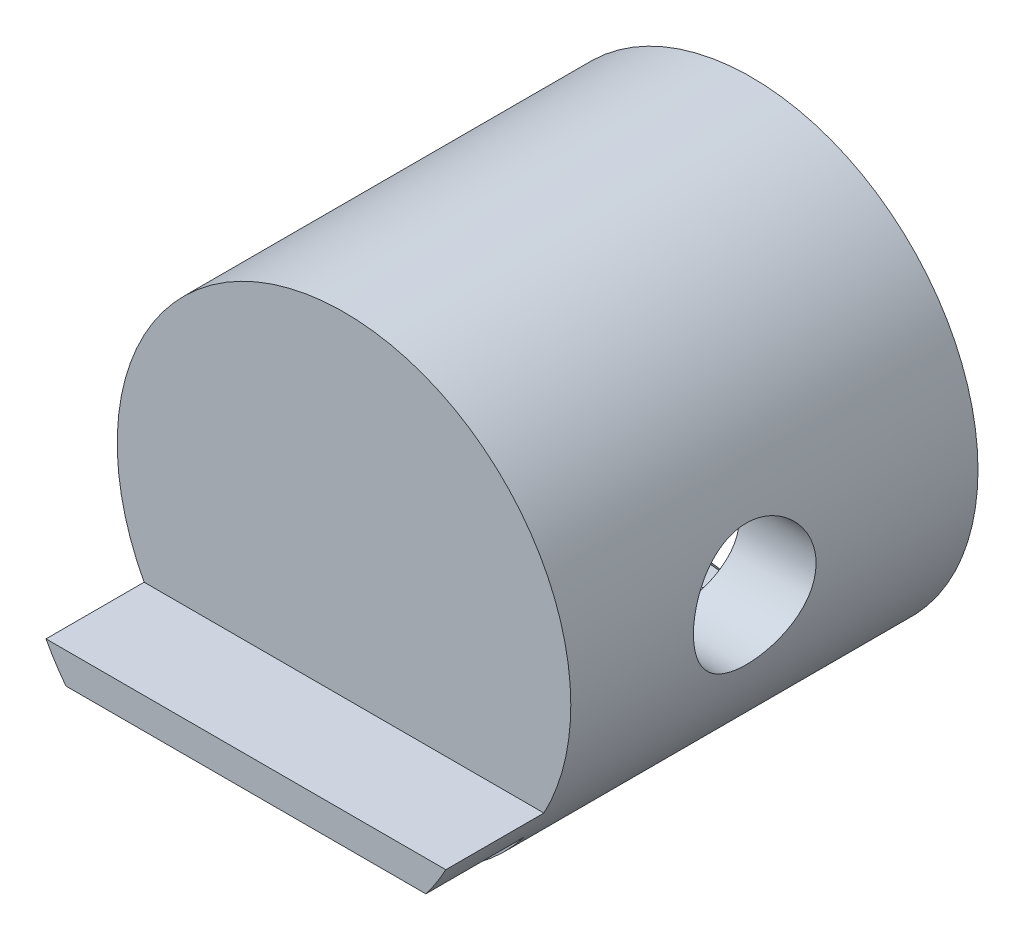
ISO-10303-21;
HEADER;
FILE_DESCRIPTION(('STEP AP214'),'2;1');
FILE_NAME('part.step','',(''),(''),'','','');
FILE_SCHEMA(('AUTOMOTIVE_DESIGN { 1 0 10303 214 1 1 1 1 }'));
ENDSEC;
DATA;
#1=APPLICATION_CONTEXT('core data for automotive mechanical design processes');
#2=APPLICATION_PROTOCOL_DEFINITION('international standard','automotive_design',2000,#1);
#3=PRODUCT_CONTEXT('',#1,'mechanical');
#4=PRODUCT('Part','Part','',(#3));
#5=PRODUCT_RELATED_PRODUCT_CATEGORY('part','',(#4));
#6=PRODUCT_DEFINITION_FORMATION('','',#4);
#7=PRODUCT_DEFINITION_CONTEXT('part definition',#1,'design');
#8=PRODUCT_DEFINITION('design','',#6,#7);
#9=PRODUCT_DEFINITION_SHAPE('','',#8);
#10=(LENGTH_UNIT() NAMED_UNIT(*) SI_UNIT(.MILLI.,.METRE.));
#11=(NAMED_UNIT(*) PLANE_ANGLE_UNIT() SI_UNIT($,.RADIAN.));
#12=(NAMED_UNIT(*) SI_UNIT($,.STERADIAN.) SOLID_ANGLE_UNIT());
#13=UNCERTAINTY_MEASURE_WITH_UNIT(LENGTH_MEASURE(1.E-05),#10,'distance_accuracy_value','');
#14=(GEOMETRIC_REPRESENTATION_CONTEXT(3) GLOBAL_UNCERTAINTY_ASSIGNED_CONTEXT((#13)) GLOBAL_UNIT_ASSIGNED_CONTEXT((#10,
#11,#12)) REPRESENTATION_CONTEXT('',''));
#15=CARTESIAN_POINT('',(0.,0.,0.));
#16=DIRECTION('',(0.,0.,1.));
#17=DIRECTION('',(1.,0.,0.));
#18=AXIS2_PLACEMENT_3D('',#15,#16,#17);
#19=CARTESIAN_POINT('',(0.,0.,26.0095999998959));
#20=DIRECTION('',(0.,0.,-1.));
#21=DIRECTION('',(-1.,0.,0.));
#22=AXIS2_PLACEMENT_3D('',#19,#20,#21);
#23=PLANE('',#22);
#24=CARTESIAN_POINT('',(0.,0.,26.0095999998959));
#25=DIRECTION('',(0.,0.,1.));
#26=DIRECTION('',(0.,1.,0.));
#27=AXIS2_PLACEMENT_3D('',#24,#25,#26);
#28=CIRCLE('',#27,12.1242666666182);
#29=CARTESIAN_POINT('',(0.,-12.1242666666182,26.0095999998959));
#30=VERTEX_POINT('',#29);
#31=CARTESIAN_POINT('',(0.,12.1242666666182,26.0095999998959));
#32=VERTEX_POINT('',#31);
#33=EDGE_CURVE('E242',#30,#32,#28,.F.);
#34=ORIENTED_EDGE('',*,*,#33,.T.);
#35=CARTESIAN_POINT('',(0.,0.,26.0095999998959));
#36=DIRECTION('',(0.,0.,1.));
#37=DIRECTION('',(0.,-1.,0.));
#38=AXIS2_PLACEMENT_3D('',#35,#36,#37);
#39=CIRCLE('',#38,12.1242666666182);
#40=EDGE_CURVE('E237',#32,#30,#39,.F.);
#41=ORIENTED_EDGE('',*,*,#40,.T.);
#42=EDGE_LOOP('',(#34,#41));
#43=FACE_BOUND('',#42,.T.);
#44=ADVANCED_FACE('F15',(#43),#23,.T.);
#45=CARTESIAN_POINT('',(0.,0.,23.909866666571));
#46=DIRECTION('',(0.,0.,-1.));
#47=DIRECTION('',(0.,-1.,0.));
#48=AXIS2_PLACEMENT_3D('',#45,#46,#47);
#49=TOROIDAL_SURFACE('',#48,12.1242666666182,2.09973333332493);
#50=ORIENTED_EDGE('',*,*,#33,.F.);
#51=ORIENTED_EDGE('',*,*,#40,.F.);
#52=EDGE_LOOP('',(#50,#51));
#53=FACE_BOUND('',#52,.T.);
#54=CARTESIAN_POINT('',(0.,0.,23.909866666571));
#55=DIRECTION('',(0.,0.,-1.));
#56=DIRECTION('',(-1.,0.,0.));
#57=AXIS2_PLACEMENT_3D('',#54,#55,#56);
#58=CIRCLE('',#57,14.2239999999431);
#59=CARTESIAN_POINT('',(-14.2239999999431,0.,23.909866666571));
#60=VERTEX_POINT('',#59);
#61=EDGE_CURVE('E246',#60,#60,#58,.T.);
#62=ORIENTED_EDGE('',*,*,#61,.T.);
#63=EDGE_LOOP('',(#62));
#64=FACE_BOUND('',#63,.T.);
#65=ADVANCED_FACE('F238',(#53,#64),#49,.F.);
#66=CARTESIAN_POINT('',(0.,0.,26.2737599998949));
#67=DIRECTION('',(0.,0.,-1.));
#68=DIRECTION('',(-1.,0.,0.));
#69=AXIS2_PLACEMENT_3D('',#66,#67,#68);
#70=CYLINDRICAL_SURFACE('',#69,14.2239999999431);
#71=ORIENTED_EDGE('',*,*,#61,.F.);
#72=EDGE_LOOP('',(#71));
#73=FACE_BOUND('',#72,.T.);
#74=CARTESIAN_POINT('',(0.,0.,22.826133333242));
#75=DIRECTION('',(0.,0.,-1.));
#76=DIRECTION('',(0.,-1.,0.));
#77=AXIS2_PLACEMENT_3D('',#74,#75,#76);
#78=CIRCLE('',#77,14.2239999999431);
#79=CARTESIAN_POINT('',(0.,-14.2239999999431,22.826133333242));
#80=VERTEX_POINT('',#79);
#81=EDGE_CURVE('E249',#80,#80,#78,.T.);
#82=ORIENTED_EDGE('',*,*,#81,.T.);
#83=EDGE_LOOP('',(#82));
#84=FACE_BOUND('',#83,.T.);
#85=ADVANCED_FACE('F261',(#73,#84),#70,.F.);
#86=CARTESIAN_POINT('',(0.,0.,4.67359999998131));
#87=DIRECTION('',(0.,0.,-1.));
#88=DIRECTION('',(0.,-1.,0.));
#89=AXIS2_PLACEMENT_3D('',#86,#87,#88);
#90=TOROIDAL_SURFACE('',#89,11.8956666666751,2.09973333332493);
#91=CARTESIAN_POINT('',(0.,0.,4.67359999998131));
#92=DIRECTION('',(0.,0.,-1.));
#93=DIRECTION('',(-1.,0.,0.));
#94=AXIS2_PLACEMENT_3D('',#91,#92,#93);
#95=CIRCLE('',#94,13.9954);
#96=CARTESIAN_POINT('',(-13.9954,0.,4.67359999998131));
#97=VERTEX_POINT('',#96);
#98=EDGE_CURVE('E253',#97,#97,#95,.T.);
#99=ORIENTED_EDGE('',*,*,#98,.T.);
#100=EDGE_LOOP('',(#99));
#101=FACE_BOUND('',#100,.T.);
#102=CARTESIAN_POINT('',(0.,0.,6.77333333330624));
#103=DIRECTION('',(0.,0.,1.));
#104=DIRECTION('',(0.,-1.,0.));
#105=AXIS2_PLACEMENT_3D('',#102,#103,#104);
#106=CIRCLE('',#105,11.8956666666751);
#107=CARTESIAN_POINT('',(0.,11.8956666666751,6.77333333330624));
#108=VERTEX_POINT('',#107);
#109=CARTESIAN_POINT('',(0.,-11.8956666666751,6.77333333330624));
#110=VERTEX_POINT('',#109);
#111=EDGE_CURVE('E180',#108,#110,#106,.F.);
#112=ORIENTED_EDGE('',*,*,#111,.F.);
#113=CARTESIAN_POINT('',(0.,0.,6.77333333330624));
#114=DIRECTION('',(0.,0.,1.));
#115=DIRECTION('',(0.,1.,0.));
#116=AXIS2_PLACEMENT_3D('',#113,#114,#115);
#117=CIRCLE('',#116,11.8956666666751);
#118=EDGE_CURVE('E168',#110,#108,#117,.F.);
#119=ORIENTED_EDGE('',*,*,#118,.F.);
#120=EDGE_LOOP('',(#112,#119));
#121=FACE_BOUND('',#120,.T.);
#122=ADVANCED_FACE('F204',(#101,#121),#90,.F.);
#123=CARTESIAN_POINT('',(0.,0.,22.826133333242));
#124=DIRECTION('',(0.,0.,-1.));
#125=DIRECTION('',(0.,-1.,0.));
#126=AXIS2_PLACEMENT_3D('',#123,#124,#125);
#127=TOROIDAL_SURFACE('',#126,12.1242666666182,2.09973333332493);
#128=ORIENTED_EDGE('',*,*,#81,.F.);
#129=EDGE_LOOP('',(#128));
#130=FACE_BOUND('',#129,.T.);
#131=CARTESIAN_POINT('',(0.,0.,20.7263999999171));
#132=DIRECTION('',(0.,0.,-1.));
#133=DIRECTION('',(0.,-1.,0.));
#134=AXIS2_PLACEMENT_3D('',#131,#132,#133);
#135=CIRCLE('',#134,12.1242666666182);
#136=CARTESIAN_POINT('',(0.,-12.1242666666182,20.7263999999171));
#137=VERTEX_POINT('',#136);
#138=CARTESIAN_POINT('',(0.,12.1242666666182,20.7263999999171));
#139=VERTEX_POINT('',#138);
#140=EDGE_CURVE('E193',#137,#139,#135,.T.);
#141=ORIENTED_EDGE('',*,*,#140,.T.);
#142=CARTESIAN_POINT('',(0.,0.,20.7263999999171));
#143=DIRECTION('',(0.,0.,-1.));
#144=DIRECTION('',(0.,1.,0.));
#145=AXIS2_PLACEMENT_3D('',#142,#143,#144);
#146=CIRCLE('',#145,12.1242666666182);
#147=EDGE_CURVE('E279',#139,#137,#146,.T.);
#148=ORIENTED_EDGE('',*,*,#147,.T.);
#149=EDGE_LOOP('',(#141,#148));
#150=FACE_BOUND('',#149,.T.);
#151=ADVANCED_FACE('F199',(#130,#150),#127,.F.);
#152=CARTESIAN_POINT('',(0.,0.,7.11199999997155));
#153=DIRECTION('',(0.,0.,-1.));
#154=DIRECTION('',(-1.,0.,0.));
#155=AXIS2_PLACEMENT_3D('',#152,#153,#154);
#156=CYLINDRICAL_SURFACE('',#155,13.9954);
#157=ORIENTED_EDGE('',*,*,#98,.F.);
#158=EDGE_LOOP('',(#157));
#159=FACE_BOUND('',#158,.T.);
#160=CARTESIAN_POINT('',(0.,0.,1.01599999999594));
#161=DIRECTION('',(0.,0.,-1.));
#162=DIRECTION('',(0.,-1.,0.));
#163=AXIS2_PLACEMENT_3D('',#160,#161,#162);
#164=CIRCLE('',#163,13.9954);
#165=CARTESIAN_POINT('',(0.,-13.9954,1.01599999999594));
#166=VERTEX_POINT('',#165);
#167=EDGE_CURVE('E184',#166,#166,#164,.T.);
#168=ORIENTED_EDGE('',*,*,#167,.T.);
#169=EDGE_LOOP('',(#168));
#170=FACE_BOUND('',#169,.T.);
#171=ADVANCED_FACE('F203',(#159,#170),#156,.F.);
#172=CARTESIAN_POINT('',(0.,0.,6.77333333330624));
#173=DIRECTION('',(0.,0.,-1.));
#174=DIRECTION('',(-1.,0.,0.));
#175=AXIS2_PLACEMENT_3D('',#172,#173,#174);
#176=PLANE('',#175);
#177=CARTESIAN_POINT('',(0.,0.,6.77333333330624));
#178=DIRECTION('',(0.,0.,1.));
#179=DIRECTION('',(1.,0.,0.));
#180=AXIS2_PLACEMENT_3D('',#177,#178,#179);
#181=CIRCLE('',#180,10.3505);
#182=CARTESIAN_POINT('',(10.3505,0.,6.77333333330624));
#183=VERTEX_POINT('',#182);
#184=EDGE_CURVE('E192',#183,#183,#181,.T.);
#185=ORIENTED_EDGE('',*,*,#184,.T.);
#186=EDGE_LOOP('',(#185));
#187=FACE_BOUND('',#186,.T.);
#188=ORIENTED_EDGE('',*,*,#118,.T.);
#189=ORIENTED_EDGE('',*,*,#111,.T.);
#190=EDGE_LOOP('',(#188,#189));
#191=FACE_BOUND('',#190,.T.);
#192=ADVANCED_FACE('F142',(#187,#191),#176,.T.);
#193=CARTESIAN_POINT('',(0.,0.,20.7263999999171));
#194=DIRECTION('',(0.,0.,-1.));
#195=DIRECTION('',(-1.,0.,0.));
#196=AXIS2_PLACEMENT_3D('',#193,#194,#195);
#197=PLANE('',#196);
#198=CARTESIAN_POINT('',(0.,0.,20.7263999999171));
#199=DIRECTION('',(0.,0.,1.));
#200=DIRECTION('',(1.,0.,0.));
#201=AXIS2_PLACEMENT_3D('',#198,#199,#200);
#202=CIRCLE('',#201,10.3505);
#203=CARTESIAN_POINT('',(10.3505,0.,20.7263999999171));
#204=VERTEX_POINT('',#203);
#205=EDGE_CURVE('E464',#204,#204,#202,.F.);
#206=ORIENTED_EDGE('',*,*,#205,.T.);
#207=EDGE_LOOP('',(#206));
#208=FACE_BOUND('',#207,.T.);
#209=ORIENTED_EDGE('',*,*,#147,.F.);
#210=ORIENTED_EDGE('',*,*,#140,.F.);
#211=EDGE_LOOP('',(#209,#210));
#212=FACE_BOUND('',#211,.T.);
#213=ADVANCED_FACE('F137',(#208,#212),#197,.F.);
#214=CARTESIAN_POINT('',(0.,0.,0.));
#215=DIRECTION('',(0.,0.,-1.));
#216=DIRECTION('',(-1.,0.,0.));
#217=AXIS2_PLACEMENT_3D('',#214,#215,#216);
#218=CONICAL_SURFACE('',#217,15.0113999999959,0.785398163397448);
#219=ORIENTED_EDGE('',*,*,#167,.F.);
#220=EDGE_LOOP('',(#219));
#221=FACE_BOUND('',#220,.T.);
#222=CARTESIAN_POINT('',(0.,0.,0.));
#223=DIRECTION('',(0.,0.,-1.));
#224=DIRECTION('',(-1.,0.,0.));
#225=AXIS2_PLACEMENT_3D('',#222,#223,#224);
#226=CIRCLE('',#225,15.0113999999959);
#227=CARTESIAN_POINT('',(-15.0113999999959,0.,0.));
#228=VERTEX_POINT('',#227);
#229=EDGE_CURVE('E456',#228,#228,#226,.T.);
#230=ORIENTED_EDGE('',*,*,#229,.T.);
#231=EDGE_LOOP('',(#230));
#232=FACE_BOUND('',#231,.T.);
#233=ADVANCED_FACE('F132',(#221,#232),#218,.F.);
#234=CARTESIAN_POINT('',(0.,0.,0.));
#235=DIRECTION('',(0.,0.,1.));
#236=DIRECTION('',(1.,0.,0.));
#237=AXIS2_PLACEMENT_3D('',#234,#235,#236);
#238=CYLINDRICAL_SURFACE('',#237,10.3505);
#239=CARTESIAN_POINT('',(9.4451966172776,4.2333333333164,15.4093333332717));
#240=CARTESIAN_POINT('',(9.44519295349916,4.23333680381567,15.5226751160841));
#241=CARTESIAN_POINT('',(9.44724114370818,4.2287793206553,15.635982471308));
#242=CARTESIAN_POINT('',(9.45535377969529,4.21061083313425,15.8617558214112));
#243=CARTESIAN_POINT('',(9.46141883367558,4.19699845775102,15.9742216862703));
#244=CARTESIAN_POINT('',(9.47736950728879,4.16085396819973,16.1974960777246));
#245=CARTESIAN_POINT('',(9.48725716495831,4.13831709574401,16.3083036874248));
#246=CARTESIAN_POINT('',(9.51052004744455,4.08456937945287,16.5274357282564));
#247=CARTESIAN_POINT('',(9.52389665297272,4.05335510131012,16.6357591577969));
#248=CARTESIAN_POINT('',(9.56854291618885,3.94737428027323,16.9551126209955));
#249=CARTESIAN_POINT('',(9.60440467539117,3.86010877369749,17.1615035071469));
#250=CARTESIAN_POINT('',(9.68426812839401,3.65510928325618,17.5566428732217));
#251=CARTESIAN_POINT('',(9.72827127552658,3.53736985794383,17.7453881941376));
#252=CARTESIAN_POINT('',(9.82238757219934,3.26727528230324,18.1112732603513));
#253=CARTESIAN_POINT('',(9.8727024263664,3.11339295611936,18.2872340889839));
#254=CARTESIAN_POINT('',(9.97213700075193,2.77844453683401,18.6117858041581));
#255=CARTESIAN_POINT('',(10.0212562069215,2.59736698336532,18.760365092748));
#256=CARTESIAN_POINT('',(10.0912129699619,2.30455545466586,18.962507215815));
#257=CARTESIAN_POINT('',(10.1143380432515,2.20109388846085,19.0275193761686));
#258=CARTESIAN_POINT('',(10.1582561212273,1.98857517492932,19.1485325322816));
#259=CARTESIAN_POINT('',(10.1790500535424,1.87952027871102,19.2045371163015));
#260=CARTESIAN_POINT('',(10.217692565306,1.65662049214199,19.306993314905));
#261=CARTESIAN_POINT('',(10.2355435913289,1.54277968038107,19.3534528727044));
#262=CARTESIAN_POINT('',(10.2677931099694,1.31109226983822,19.4364031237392));
#263=CARTESIAN_POINT('',(10.2821924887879,1.19324670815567,19.4728963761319));
#264=CARTESIAN_POINT('',(10.3128379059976,0.89939141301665,19.5499471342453));
#265=CARTESIAN_POINT('',(10.3268840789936,0.721572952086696,19.5846459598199));
#266=CARTESIAN_POINT('',(10.3457123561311,0.362473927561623,19.6310015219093));
#267=CARTESIAN_POINT('',(10.3504957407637,0.181193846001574,19.6426614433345));
#268=CARTESIAN_POINT('',(10.3505026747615,-0.113788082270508,19.6426699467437));
#269=CARTESIAN_POINT('',(10.3486205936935,-0.227542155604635,19.6380769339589));
#270=CARTESIAN_POINT('',(10.3411497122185,-0.454224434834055,19.6197626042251));
#271=CARTESIAN_POINT('',(10.3355602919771,-0.567152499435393,19.6060397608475));
#272=CARTESIAN_POINT('',(10.3208150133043,-0.791361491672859,19.5695931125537));
#273=CARTESIAN_POINT('',(10.3116575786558,-0.902641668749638,19.5468653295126));
#274=CARTESIAN_POINT('',(10.2900235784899,-1.12273101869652,19.4926473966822));
#275=CARTESIAN_POINT('',(10.2775457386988,-1.23153922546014,19.4611538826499));
#276=CARTESIAN_POINT('',(10.2356696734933,-1.5524766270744,19.354149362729));
#277=CARTESIAN_POINT('',(10.2017703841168,-1.75995470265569,19.2659763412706));
#278=CARTESIAN_POINT('',(10.1252830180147,-2.15697024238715,19.0588307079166));
#279=CARTESIAN_POINT('',(10.082693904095,-2.34650556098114,18.9398544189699));
#280=CARTESIAN_POINT('',(9.9908074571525,-2.71175596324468,18.6684022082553));
#281=CARTESIAN_POINT('',(9.94129663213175,-2.88648790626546,18.514676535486));
#282=CARTESIAN_POINT('',(9.84206376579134,-3.20859638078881,18.1805871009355));
#283=CARTESIAN_POINT('',(9.79234162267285,-3.35595770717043,18.0002086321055));
#284=CARTESIAN_POINT('',(9.72046643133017,-3.55679347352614,17.7082930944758));
#285=CARTESIAN_POINT('',(9.69645024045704,-3.6215838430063,17.6048252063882));
#286=CARTESIAN_POINT('',(9.65055844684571,-3.74215541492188,17.3923326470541));
#287=CARTESIAN_POINT('',(9.62868199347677,-3.79794020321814,17.2833102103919));
#288=CARTESIAN_POINT('',(9.58780919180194,-3.89997298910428,17.0604914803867));
#289=CARTESIAN_POINT('',(9.56881022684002,-3.94622966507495,16.9466996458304));
#290=CARTESIAN_POINT('',(9.53433895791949,-4.02879962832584,16.715090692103));
#291=CARTESIAN_POINT('',(9.51886569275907,-4.06511562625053,16.5972746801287));
#292=CARTESIAN_POINT('',(9.48594347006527,-4.14152157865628,16.3043349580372));
#293=CARTESIAN_POINT('',(9.47077176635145,-4.17587604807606,16.1274154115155));
#294=CARTESIAN_POINT('',(9.45040223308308,-4.22177692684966,15.7700788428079));
#295=CARTESIAN_POINT('',(9.44520244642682,-4.23332781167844,15.5896625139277));
#296=CARTESIAN_POINT('',(9.44519295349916,-4.23333680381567,15.2959915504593));
#297=CARTESIAN_POINT('',(9.44724114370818,-4.2287793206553,15.1826841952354));
#298=CARTESIAN_POINT('',(9.45535377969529,-4.21061083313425,14.9569108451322));
#299=CARTESIAN_POINT('',(9.46141883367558,-4.19699845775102,14.8444449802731));
#300=CARTESIAN_POINT('',(9.47736950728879,-4.16085396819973,14.6211705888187));
#301=CARTESIAN_POINT('',(9.48725716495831,-4.13831709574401,14.5103629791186));
#302=CARTESIAN_POINT('',(9.51052004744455,-4.08456937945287,14.291230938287));
#303=CARTESIAN_POINT('',(9.52389665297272,-4.05335510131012,14.1829075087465));
#304=CARTESIAN_POINT('',(9.56854291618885,-3.94737428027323,13.8635540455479));
#305=CARTESIAN_POINT('',(9.60440467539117,-3.86010877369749,13.6571631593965));
#306=CARTESIAN_POINT('',(9.68426812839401,-3.65510928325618,13.2620237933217));
#307=CARTESIAN_POINT('',(9.72827127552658,-3.53736985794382,13.0732784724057));
#308=CARTESIAN_POINT('',(9.82238757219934,-3.26727528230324,12.7073934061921));
#309=CARTESIAN_POINT('',(9.8727024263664,-3.11339295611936,12.5314325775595));
#310=CARTESIAN_POINT('',(9.97213700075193,-2.77844453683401,12.2068808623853));
#311=CARTESIAN_POINT('',(10.0212562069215,-2.59736698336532,12.0583015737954));
#312=CARTESIAN_POINT('',(10.0912129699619,-2.30455545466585,11.8561594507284));
#313=CARTESIAN_POINT('',(10.1143380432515,-2.20109388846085,11.7911472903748));
#314=CARTESIAN_POINT('',(10.1582561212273,-1.98857517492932,11.6701341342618));
#315=CARTESIAN_POINT('',(10.1790500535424,-1.87952027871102,11.6141295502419));
#316=CARTESIAN_POINT('',(10.217692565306,-1.65662049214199,11.5116733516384));
#317=CARTESIAN_POINT('',(10.2355435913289,-1.54277968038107,11.465213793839));
#318=CARTESIAN_POINT('',(10.2677931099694,-1.31109226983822,11.3822635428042));
#319=CARTESIAN_POINT('',(10.2821924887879,-1.19324670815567,11.3457702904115));
#320=CARTESIAN_POINT('',(10.3128379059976,-0.899391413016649,11.2687195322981));
#321=CARTESIAN_POINT('',(10.3268840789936,-0.721572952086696,11.2340207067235));
#322=CARTESIAN_POINT('',(10.3457123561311,-0.362473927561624,11.1876651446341));
#323=CARTESIAN_POINT('',(10.3504957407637,-0.181193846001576,11.1760052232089));
#324=CARTESIAN_POINT('',(10.3505026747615,0.113788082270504,11.1759967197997));
#325=CARTESIAN_POINT('',(10.3486205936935,0.227542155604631,11.1805897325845));
#326=CARTESIAN_POINT('',(10.3411497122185,0.454224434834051,11.1989040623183));
#327=CARTESIAN_POINT('',(10.3355602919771,0.567152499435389,11.2126269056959));
#328=CARTESIAN_POINT('',(10.3208150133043,0.791361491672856,11.2490735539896));
#329=CARTESIAN_POINT('',(10.3116575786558,0.902641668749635,11.2718013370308));
#330=CARTESIAN_POINT('',(10.2900235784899,1.12273101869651,11.3260192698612));
#331=CARTESIAN_POINT('',(10.2775457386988,1.23153922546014,11.3575127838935));
#332=CARTESIAN_POINT('',(10.2356696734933,1.55247662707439,11.4645173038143));
#333=CARTESIAN_POINT('',(10.2017703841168,1.75995470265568,11.5526903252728));
#334=CARTESIAN_POINT('',(10.1252830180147,2.15697024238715,11.7598359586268));
#335=CARTESIAN_POINT('',(10.082693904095,2.34650556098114,11.8788122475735));
#336=CARTESIAN_POINT('',(9.9908074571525,2.71175596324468,12.1502644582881));
#337=CARTESIAN_POINT('',(9.94129663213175,2.88648790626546,12.3039901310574));
#338=CARTESIAN_POINT('',(9.84206376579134,3.2085963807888,12.6380795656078));
#339=CARTESIAN_POINT('',(9.79234162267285,3.35595770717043,12.8184580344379));
#340=CARTESIAN_POINT('',(9.72046643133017,3.55679347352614,13.1103735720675));
#341=CARTESIAN_POINT('',(9.69645024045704,3.6215838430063,13.2138414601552));
#342=CARTESIAN_POINT('',(9.65055844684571,3.74215541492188,13.4263340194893));
#343=CARTESIAN_POINT('',(9.62868199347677,3.79794020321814,13.5353564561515));
#344=CARTESIAN_POINT('',(9.58780919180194,3.89997298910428,13.7581751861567));
#345=CARTESIAN_POINT('',(9.56881022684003,3.94622966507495,13.871967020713));
#346=CARTESIAN_POINT('',(9.5343389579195,4.02879962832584,14.1035759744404));
#347=CARTESIAN_POINT('',(9.51886569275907,4.06511562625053,14.2213919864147));
#348=CARTESIAN_POINT('',(9.48594347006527,4.14152157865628,14.5143317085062));
#349=CARTESIAN_POINT('',(9.47077176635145,4.17587604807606,14.6912512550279));
#350=CARTESIAN_POINT('',(9.45040223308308,4.22177692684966,15.0485878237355));
#351=CARTESIAN_POINT('',(9.44520244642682,4.23332781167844,15.2290041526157));
#352=CARTESIAN_POINT('',(9.4451966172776,4.2333333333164,15.4093333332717));
#353=B_SPLINE_CURVE_WITH_KNOTS('',3,(#239,#240,#241,#242,#243,#244,#245,#246,#247,#248,#249,
#250,#251,#252,#253,#254,#255,#256,#257,#258,#259,#260,#261,#262,#263,#264,#265,#266,#267,#268,
#269,#270,#271,#272,#273,#274,#275,#276,#277,#278,#279,#280,#281,#282,#283,#284,#285,#286,#287,
#288,#289,#290,#291,#292,#293,#294,#295,#296,#297,#298,#299,#300,#301,#302,#303,#304,#305,#306,
#307,#308,#309,#310,#311,#312,#313,#314,#315,#316,#317,#318,#319,#320,#321,#322,#323,#324,#325,
#326,#327,#328,#329,#330,#331,#332,#333,#334,#335,#336,#337,#338,#339,#340,#341,#342,#343,#344,
#345,#346,#347,#348,#349,#350,#351,#352),.UNSPECIFIED.,.T.,.F.,(4,2,2,2,2,2,2,2,2,2,2,2,2,2,2,2,
2,2,2,2,2,2,2,2,2,2,2,2,2,2,2,2,2,2,2,2,2,2,2,2,2,2,2,2,2,2,2,2,2,2,2,2,2,2,2,2,4),(0.,
0.339855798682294,0.67976306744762,1.01985180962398,1.36007534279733,2.03757886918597,
2.71520345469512,3.42945860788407,4.1440156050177,4.5167025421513,4.88924064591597,
5.26146746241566,5.63359860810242,6.17698905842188,6.72030438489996,7.06150145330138,
7.4027555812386,7.74416063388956,8.08569689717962,8.76625335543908,9.44689109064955,
10.1576575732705,10.8688177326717,11.2416852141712,11.6144038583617,11.9867815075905,
12.3590575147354,12.8998814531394,13.4405992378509,13.7804550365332,14.1203623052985,
14.4604510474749,14.8006745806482,15.4781781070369,16.155802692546,16.870057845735,
17.5846148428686,17.9573017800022,18.3298398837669,18.7020667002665,19.0741978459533,
19.6175882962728,20.1609036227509,20.5021006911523,20.8433548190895,21.1847598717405,
21.5262961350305,22.20685259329,22.8874903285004,23.5982568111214,24.3094169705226,
24.6822844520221,25.0550030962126,25.4273807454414,25.7996567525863,26.3404806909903,
26.8811984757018),.UNSPECIFIED.);
#354=CARTESIAN_POINT('',(9.4451966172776,4.2333333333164,15.4093333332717));
#355=VERTEX_POINT('',#354);
#356=EDGE_CURVE('E123',#355,#355,#353,.T.);
#357=ORIENTED_EDGE('',*,*,#356,.T.);
#358=EDGE_LOOP('',(#357));
#359=FACE_BOUND('',#358,.T.);
#360=ORIENTED_EDGE('',*,*,#205,.F.);
#361=EDGE_LOOP('',(#360));
#362=FACE_BOUND('',#361,.T.);
#363=CARTESIAN_POINT('',(-10.3505,0.,11.1759999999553));
#364=CARTESIAN_POINT('',(-10.3505026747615,-0.113788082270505,11.1759967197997));
#365=CARTESIAN_POINT('',(-10.3486205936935,-0.227542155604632,11.1805897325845));
#366=CARTESIAN_POINT('',(-10.3411497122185,-0.454224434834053,11.1989040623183));
#367=CARTESIAN_POINT('',(-10.3355602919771,-0.567152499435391,11.2126269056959));
#368=CARTESIAN_POINT('',(-10.3208150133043,-0.791361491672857,11.2490735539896));
#369=CARTESIAN_POINT('',(-10.3116575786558,-0.902641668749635,11.2718013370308));
#370=CARTESIAN_POINT('',(-10.2900235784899,-1.12273101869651,11.3260192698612));
#371=CARTESIAN_POINT('',(-10.2775457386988,-1.23153922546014,11.3575127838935));
#372=CARTESIAN_POINT('',(-10.2356696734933,-1.55247662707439,11.4645173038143));
#373=CARTESIAN_POINT('',(-10.2017703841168,-1.75995470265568,11.5526903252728));
#374=CARTESIAN_POINT('',(-10.1252830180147,-2.15697024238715,11.7598359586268));
#375=CARTESIAN_POINT('',(-10.082693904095,-2.34650556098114,11.8788122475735));
#376=CARTESIAN_POINT('',(-9.9908074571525,-2.71175596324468,12.1502644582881));
#377=CARTESIAN_POINT('',(-9.94129663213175,-2.88648790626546,12.3039901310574));
#378=CARTESIAN_POINT('',(-9.84206376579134,-3.2085963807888,12.6380795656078));
#379=CARTESIAN_POINT('',(-9.79234162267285,-3.35595770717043,12.8184580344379));
#380=CARTESIAN_POINT('',(-9.72046643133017,-3.55679347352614,13.1103735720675));
#381=CARTESIAN_POINT('',(-9.69645024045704,-3.6215838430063,13.2138414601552));
#382=CARTESIAN_POINT('',(-9.65055844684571,-3.74215541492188,13.4263340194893));
#383=CARTESIAN_POINT('',(-9.62868199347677,-3.79794020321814,13.5353564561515));
#384=CARTESIAN_POINT('',(-9.58780919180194,-3.89997298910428,13.7581751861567));
#385=CARTESIAN_POINT('',(-9.56881022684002,-3.94622966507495,13.871967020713));
#386=CARTESIAN_POINT('',(-9.5343389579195,-4.02879962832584,14.1035759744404));
#387=CARTESIAN_POINT('',(-9.51886569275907,-4.06511562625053,14.2213919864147));
#388=CARTESIAN_POINT('',(-9.48594347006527,-4.14152157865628,14.5143317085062));
#389=CARTESIAN_POINT('',(-9.47077176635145,-4.17587604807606,14.6912512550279));
#390=CARTESIAN_POINT('',(-9.45040223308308,-4.22177692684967,15.0485878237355));
#391=CARTESIAN_POINT('',(-9.44520244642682,-4.23332781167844,15.2290041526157));
#392=CARTESIAN_POINT('',(-9.44519295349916,-4.23333680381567,15.5226751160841));
#393=CARTESIAN_POINT('',(-9.44724114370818,-4.2287793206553,15.635982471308));
#394=CARTESIAN_POINT('',(-9.45535377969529,-4.21061083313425,15.8617558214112));
#395=CARTESIAN_POINT('',(-9.46141883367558,-4.19699845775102,15.9742216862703));
#396=CARTESIAN_POINT('',(-9.47736950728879,-4.16085396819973,16.1974960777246));
#397=CARTESIAN_POINT('',(-9.48725716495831,-4.13831709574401,16.3083036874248));
#398=CARTESIAN_POINT('',(-9.51052004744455,-4.08456937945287,16.5274357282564));
#399=CARTESIAN_POINT('',(-9.52389665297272,-4.05335510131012,16.6357591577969));
#400=CARTESIAN_POINT('',(-9.56854291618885,-3.94737428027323,16.9551126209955));
#401=CARTESIAN_POINT('',(-9.60440467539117,-3.86010877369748,17.1615035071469));
#402=CARTESIAN_POINT('',(-9.68426812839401,-3.65510928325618,17.5566428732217));
#403=CARTESIAN_POINT('',(-9.72827127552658,-3.53736985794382,17.7453881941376));
#404=CARTESIAN_POINT('',(-9.82238757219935,-3.26727528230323,18.1112732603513));
#405=CARTESIAN_POINT('',(-9.87270242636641,-3.11339295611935,18.2872340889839));
#406=CARTESIAN_POINT('',(-9.97213700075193,-2.778444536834,18.6117858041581));
#407=CARTESIAN_POINT('',(-10.0212562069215,-2.59736698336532,18.760365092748));
#408=CARTESIAN_POINT('',(-10.0912129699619,-2.30455545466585,18.962507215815));
#409=CARTESIAN_POINT('',(-10.1143380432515,-2.20109388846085,19.0275193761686));
#410=CARTESIAN_POINT('',(-10.1582561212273,-1.98857517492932,19.1485325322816));
#411=CARTESIAN_POINT('',(-10.1790500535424,-1.87952027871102,19.2045371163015));
#412=CARTESIAN_POINT('',(-10.217692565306,-1.65662049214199,19.306993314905));
#413=CARTESIAN_POINT('',(-10.2355435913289,-1.54277968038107,19.3534528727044));
#414=CARTESIAN_POINT('',(-10.2677931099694,-1.31109226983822,19.4364031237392));
#415=CARTESIAN_POINT('',(-10.2821924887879,-1.19324670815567,19.4728963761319));
#416=CARTESIAN_POINT('',(-10.3128379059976,-0.899391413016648,19.5499471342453));
#417=CARTESIAN_POINT('',(-10.3268840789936,-0.721572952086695,19.5846459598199));
#418=CARTESIAN_POINT('',(-10.3457123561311,-0.362473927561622,19.6310015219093));
#419=CARTESIAN_POINT('',(-10.3504957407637,-0.181193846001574,19.6426614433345));
#420=CARTESIAN_POINT('',(-10.3505026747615,0.113788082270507,19.6426699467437));
#421=CARTESIAN_POINT('',(-10.3486205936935,0.227542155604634,19.6380769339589));
#422=CARTESIAN_POINT('',(-10.3411497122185,0.454224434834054,19.6197626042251));
#423=CARTESIAN_POINT('',(-10.3355602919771,0.567152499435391,19.6060397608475));
#424=CARTESIAN_POINT('',(-10.3208150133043,0.791361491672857,19.5695931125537));
#425=CARTESIAN_POINT('',(-10.3116575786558,0.902641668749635,19.5468653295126));
#426=CARTESIAN_POINT('',(-10.2900235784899,1.12273101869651,19.4926473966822));
#427=CARTESIAN_POINT('',(-10.2775457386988,1.23153922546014,19.4611538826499));
#428=CARTESIAN_POINT('',(-10.2356696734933,1.55247662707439,19.354149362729));
#429=CARTESIAN_POINT('',(-10.2017703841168,1.75995470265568,19.2659763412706));
#430=CARTESIAN_POINT('',(-10.1252830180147,2.15697024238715,19.0588307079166));
#431=CARTESIAN_POINT('',(-10.082693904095,2.34650556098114,18.9398544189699));
#432=CARTESIAN_POINT('',(-9.9908074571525,2.71175596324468,18.6684022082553));
#433=CARTESIAN_POINT('',(-9.94129663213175,2.88648790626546,18.514676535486));
#434=CARTESIAN_POINT('',(-9.84206376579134,3.2085963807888,18.1805871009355));
#435=CARTESIAN_POINT('',(-9.79234162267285,3.35595770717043,18.0002086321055));
#436=CARTESIAN_POINT('',(-9.72046643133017,3.55679347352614,17.7082930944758));
#437=CARTESIAN_POINT('',(-9.69645024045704,3.6215838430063,17.6048252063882));
#438=CARTESIAN_POINT('',(-9.65055844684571,3.74215541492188,17.3923326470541));
#439=CARTESIAN_POINT('',(-9.62868199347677,3.79794020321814,17.2833102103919));
#440=CARTESIAN_POINT('',(-9.58780919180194,3.89997298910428,17.0604914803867));
#441=CARTESIAN_POINT('',(-9.56881022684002,3.94622966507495,16.9466996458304));
#442=CARTESIAN_POINT('',(-9.53433895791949,4.02879962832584,16.715090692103));
#443=CARTESIAN_POINT('',(-9.51886569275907,4.06511562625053,16.5972746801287));
#444=CARTESIAN_POINT('',(-9.48594347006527,4.14152157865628,16.3043349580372));
#445=CARTESIAN_POINT('',(-9.47077176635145,4.17587604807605,16.1274154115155));
#446=CARTESIAN_POINT('',(-9.45040223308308,4.22177692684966,15.7700788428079));
#447=CARTESIAN_POINT('',(-9.44520244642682,4.23332781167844,15.5896625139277));
#448=CARTESIAN_POINT('',(-9.44519295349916,4.23333680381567,15.2959915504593));
#449=CARTESIAN_POINT('',(-9.44724114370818,4.2287793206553,15.1826841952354));
#450=CARTESIAN_POINT('',(-9.45535377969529,4.21061083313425,14.9569108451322));
#451=CARTESIAN_POINT('',(-9.46141883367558,4.19699845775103,14.8444449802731));
#452=CARTESIAN_POINT('',(-9.47736950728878,4.16085396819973,14.6211705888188));
#453=CARTESIAN_POINT('',(-9.48725716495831,4.13831709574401,14.5103629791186));
#454=CARTESIAN_POINT('',(-9.51052004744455,4.08456937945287,14.291230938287));
#455=CARTESIAN_POINT('',(-9.52389665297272,4.05335510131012,14.1829075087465));
#456=CARTESIAN_POINT('',(-9.56854291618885,3.94737428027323,13.8635540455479));
#457=CARTESIAN_POINT('',(-9.60440467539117,3.86010877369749,13.6571631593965));
#458=CARTESIAN_POINT('',(-9.68426812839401,3.65510928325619,13.2620237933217));
#459=CARTESIAN_POINT('',(-9.72827127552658,3.53736985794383,13.0732784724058));
#460=CARTESIAN_POINT('',(-9.82238757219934,3.26727528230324,12.7073934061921));
#461=CARTESIAN_POINT('',(-9.8727024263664,3.11339295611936,12.5314325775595));
#462=CARTESIAN_POINT('',(-9.97213700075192,2.77844453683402,12.2068808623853));
#463=CARTESIAN_POINT('',(-10.0212562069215,2.59736698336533,12.0583015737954));
#464=CARTESIAN_POINT('',(-10.0912129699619,2.30455545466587,11.8561594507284));
#465=CARTESIAN_POINT('',(-10.1143380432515,2.20109388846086,11.7911472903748));
#466=CARTESIAN_POINT('',(-10.1582561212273,1.98857517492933,11.6701341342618));
#467=CARTESIAN_POINT('',(-10.1790500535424,1.87952027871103,11.6141295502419));
#468=CARTESIAN_POINT('',(-10.217692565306,1.65662049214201,11.5116733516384));
#469=CARTESIAN_POINT('',(-10.2355435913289,1.54277968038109,11.465213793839));
#470=CARTESIAN_POINT('',(-10.2677931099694,1.31109226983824,11.3822635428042));
#471=CARTESIAN_POINT('',(-10.2821924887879,1.19324670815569,11.3457702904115));
#472=CARTESIAN_POINT('',(-10.3128379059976,0.899391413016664,11.2687195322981));
#473=CARTESIAN_POINT('',(-10.3268840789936,0.721572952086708,11.2340207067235));
#474=CARTESIAN_POINT('',(-10.3457123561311,0.36247392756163,11.1876651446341));
#475=CARTESIAN_POINT('',(-10.3504957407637,0.181193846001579,11.1760052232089));
#476=CARTESIAN_POINT('',(-10.3505,0.,11.1759999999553));
#477=B_SPLINE_CURVE_WITH_KNOTS('',3,(#363,#364,#365,#366,#367,#368,#369,#370,#371,#372,#373,
#374,#375,#376,#377,#378,#379,#380,#381,#382,#383,#384,#385,#386,#387,#388,#389,#390,#391,#392,
#393,#394,#395,#396,#397,#398,#399,#400,#401,#402,#403,#404,#405,#406,#407,#408,#409,#410,#411,
#412,#413,#414,#415,#416,#417,#418,#419,#420,#421,#422,#423,#424,#425,#426,#427,#428,#429,#430,
#431,#432,#433,#434,#435,#436,#437,#438,#439,#440,#441,#442,#443,#444,#445,#446,#447,#448,#449,
#450,#451,#452,#453,#454,#455,#456,#457,#458,#459,#460,#461,#462,#463,#464,#465,#466,#467,#468,
#469,#470,#471,#472,#473,#474,#475,#476),.UNSPECIFIED.,.T.,.F.,(4,2,2,2,2,2,2,2,2,2,2,2,2,2,2,2,
2,2,2,2,2,2,2,2,2,2,2,2,2,2,2,2,2,2,2,2,2,2,2,2,2,2,2,2,2,2,2,2,2,2,2,2,2,2,2,2,4),(0.,
0.341197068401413,0.682451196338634,1.0238562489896,1.36539251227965,2.04594897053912,
2.72658670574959,3.43735318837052,4.14851334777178,4.52138082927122,4.89409947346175,
5.26647712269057,5.63875312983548,6.17957706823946,6.72029485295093,7.06015065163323,
7.40005792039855,7.74014666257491,8.08037019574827,8.75787372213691,9.43549830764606,
10.149753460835,10.8643104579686,11.2369973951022,11.6095354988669,11.9817623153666,
12.3538934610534,12.8972839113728,13.4405992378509,13.7817963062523,14.1230504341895,
14.4644554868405,14.8059917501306,15.48654820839,16.1671859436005,16.8779524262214,
17.5891125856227,17.9619800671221,18.3346987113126,18.7070763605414,19.0793523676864,
19.6201763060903,20.1608940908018,20.5007498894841,20.8406571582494,21.1807459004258,
21.5209694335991,22.1984729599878,22.8760975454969,23.5903526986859,24.3049096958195,
24.6775966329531,25.0501347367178,25.4223615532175,25.7944926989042,26.3378831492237,
26.8811984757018),.UNSPECIFIED.);
#478=CARTESIAN_POINT('',(-10.3505,0.,11.1759999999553));
#479=VERTEX_POINT('',#478);
#480=EDGE_CURVE('E116',#479,#479,#477,.T.);
#481=ORIENTED_EDGE('',*,*,#480,.T.);
#482=EDGE_LOOP('',(#481));
#483=FACE_BOUND('',#482,.T.);
#484=ORIENTED_EDGE('',*,*,#184,.F.);
#485=EDGE_LOOP('',(#484));
#486=FACE_BOUND('',#485,.T.);
#487=ADVANCED_FACE('F127',(#359,#362,#483,#486),#238,.F.);
#488=CARTESIAN_POINT('',(0.,0.,0.));
#489=DIRECTION('',(0.,0.,1.));
#490=DIRECTION('',(1.,0.,0.));
#491=AXIS2_PLACEMENT_3D('',#488,#489,#490);
#492=PLANE('',#491);
#493=ORIENTED_EDGE('',*,*,#229,.F.);
#494=EDGE_LOOP('',(#493));
#495=FACE_BOUND('',#494,.T.);
#496=CARTESIAN_POINT('',(0.,0.,0.));
#497=DIRECTION('',(0.,0.,1.));
#498=DIRECTION('',(1.,0.,0.));
#499=AXIS2_PLACEMENT_3D('',#496,#497,#498);
#500=CIRCLE('',#499,15.65402);
#501=CARTESIAN_POINT('',(15.65402,0.,0.));
#502=VERTEX_POINT('',#501);
#503=EDGE_CURVE('E97',#502,#502,#500,.T.);
#504=ORIENTED_EDGE('',*,*,#503,.F.);
#505=EDGE_LOOP('',(#504));
#506=FACE_BOUND('',#505,.T.);
#507=ADVANCED_FACE('F131',(#495,#506),#492,.F.);
#508=CARTESIAN_POINT('',(-18.784824,0.,15.4093333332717));
#509=DIRECTION('',(1.,0.,0.));
#510=DIRECTION('',(0.,0.,-1.));
#511=AXIS2_PLACEMENT_3D('',#508,#509,#510);
#512=CYLINDRICAL_SURFACE('',#511,4.2333333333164);
#513=CARTESIAN_POINT('',(15.65402,0.,11.1759999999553));
#514=CARTESIAN_POINT('',(15.6540136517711,-0.233150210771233,11.1760100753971));
#515=CARTESIAN_POINT('',(15.6487574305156,-0.466430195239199,11.1953338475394));
#516=CARTESIAN_POINT('',(15.6282878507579,-0.926339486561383,11.2720073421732));
#517=CARTESIAN_POINT('',(15.613065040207,-1.15296226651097,11.3293931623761));
#518=CARTESIAN_POINT('',(15.5743441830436,-1.59273885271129,11.4801805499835));
#519=CARTESIAN_POINT('',(15.5508584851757,-1.80591220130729,11.5735283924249));
#520=CARTESIAN_POINT('',(15.4980916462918,-2.21354850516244,11.7934015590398));
#521=CARTESIAN_POINT('',(15.4688107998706,-2.40801241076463,11.9199251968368));
#522=CARTESIAN_POINT('',(15.4068313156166,-2.7773622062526,12.2057332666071));
#523=CARTESIAN_POINT('',(15.3740730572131,-2.95174149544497,12.3656594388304));
#524=CARTESIAN_POINT('',(15.3092030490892,-3.27159652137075,12.7124054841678));
#525=CARTESIAN_POINT('',(15.2770915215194,-3.4170624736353,12.8992344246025));
#526=CARTESIAN_POINT('',(15.2165324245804,-3.67746181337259,13.2985894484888));
#527=CARTESIAN_POINT('',(15.1881618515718,-3.79179372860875,13.5115200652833));
#528=CARTESIAN_POINT('',(15.1392225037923,-3.98272404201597,13.9543390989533));
#529=CARTESIAN_POINT('',(15.1186445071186,-4.05936707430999,14.1842070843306));
#530=CARTESIAN_POINT('',(15.0926254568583,-4.15482366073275,14.5808982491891));
#531=CARTESIAN_POINT('',(15.0844665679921,-4.18421167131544,14.7450757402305));
#532=CARTESIAN_POINT('',(15.0735218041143,-4.2234697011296,15.0759244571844));
#533=CARTESIAN_POINT('',(15.0707356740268,-4.23334064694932,15.2425955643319));
#534=CARTESIAN_POINT('',(15.0707481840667,-4.23332311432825,15.642308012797));
#535=CARTESIAN_POINT('',(15.0762050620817,-4.21402743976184,15.8754128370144));
#536=CARTESIAN_POINT('',(15.0973887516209,-4.13747571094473,16.3349577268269));
#537=CARTESIAN_POINT('',(15.1131254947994,-4.08018294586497,16.5613911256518));
#538=CARTESIAN_POINT('',(15.152955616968,-3.92966742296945,17.0007663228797));
#539=CARTESIAN_POINT('',(15.1770355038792,-3.83650264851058,17.2137292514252));
#540=CARTESIAN_POINT('',(15.230821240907,-3.61706138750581,17.6210085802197));
#541=CARTESIAN_POINT('',(15.2605268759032,-3.49078616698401,17.8153256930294));
#542=CARTESIAN_POINT('',(15.323074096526,-3.20523721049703,18.1848218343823));
#543=CARTESIAN_POINT('',(15.3559724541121,-3.04526577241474,18.3594521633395));
#544=CARTESIAN_POINT('',(15.4207163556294,-2.69832147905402,18.6797972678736));
#545=CARTESIAN_POINT('',(15.4525615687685,-2.51134023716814,18.8255030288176));
#546=CARTESIAN_POINT('',(15.5122515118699,-2.11183289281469,19.0861694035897));
#547=CARTESIAN_POINT('',(15.5400194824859,-1.89892827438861,19.2005684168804));
#548=CARTESIAN_POINT('',(15.5877289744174,-1.45616414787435,19.3916302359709));
#549=CARTESIAN_POINT('',(15.6076795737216,-1.22632467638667,19.4683368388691));
#550=CARTESIAN_POINT('',(15.6328757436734,-0.829468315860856,19.5639599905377));
#551=CARTESIAN_POINT('',(15.6407631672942,-0.66508269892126,19.5934223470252));
#552=CARTESIAN_POINT('',(15.6513374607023,-0.33382016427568,19.6327788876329));
#553=CARTESIAN_POINT('',(15.6540245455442,-0.166943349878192,19.6426738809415));
#554=CARTESIAN_POINT('',(15.6540136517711,0.23315021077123,19.6426565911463));
#555=CARTESIAN_POINT('',(15.6487574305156,0.466430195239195,19.623332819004));
#556=CARTESIAN_POINT('',(15.6282878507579,0.92633948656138,19.5466593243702));
#557=CARTESIAN_POINT('',(15.613065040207,1.15296226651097,19.4892735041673));
#558=CARTESIAN_POINT('',(15.5743441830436,1.59273885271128,19.3384861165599));
#559=CARTESIAN_POINT('',(15.5508584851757,1.80591220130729,19.2451382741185));
#560=CARTESIAN_POINT('',(15.4980916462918,2.21354850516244,19.0252651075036));
#561=CARTESIAN_POINT('',(15.4688107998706,2.40801241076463,18.8987414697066));
#562=CARTESIAN_POINT('',(15.4068313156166,2.7773622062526,18.6129333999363));
#563=CARTESIAN_POINT('',(15.3740730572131,2.95174149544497,18.453007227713));
#564=CARTESIAN_POINT('',(15.3092030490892,3.27159652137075,18.1062611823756));
#565=CARTESIAN_POINT('',(15.2770915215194,3.41706247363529,17.9194322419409));
#566=CARTESIAN_POINT('',(15.2165324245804,3.67746181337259,17.5200772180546));
#567=CARTESIAN_POINT('',(15.1881618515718,3.79179372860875,17.3071466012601));
#568=CARTESIAN_POINT('',(15.1392225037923,3.98272404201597,16.86432756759));
#569=CARTESIAN_POINT('',(15.1186445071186,4.05936707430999,16.6344595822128));
#570=CARTESIAN_POINT('',(15.0926254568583,4.15482366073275,16.2377684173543));
#571=CARTESIAN_POINT('',(15.0844665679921,4.18421167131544,16.0735909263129));
#572=CARTESIAN_POINT('',(15.0735218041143,4.2234697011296,15.742742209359));
#573=CARTESIAN_POINT('',(15.0707356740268,4.23334064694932,15.5760711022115));
#574=CARTESIAN_POINT('',(15.0707481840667,4.23332311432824,15.1763586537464));
#575=CARTESIAN_POINT('',(15.0762050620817,4.21402743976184,14.943253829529));
#576=CARTESIAN_POINT('',(15.0973887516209,4.13747571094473,14.4837089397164));
#577=CARTESIAN_POINT('',(15.1131254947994,4.08018294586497,14.2572755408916));
#578=CARTESIAN_POINT('',(15.152955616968,3.92966742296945,13.8179003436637));
#579=CARTESIAN_POINT('',(15.1770355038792,3.83650264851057,13.6049374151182));
#580=CARTESIAN_POINT('',(15.230821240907,3.6170613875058,13.1976580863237));
#581=CARTESIAN_POINT('',(15.2605268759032,3.490786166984,13.003340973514));
#582=CARTESIAN_POINT('',(15.323074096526,3.20523721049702,12.6338448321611));
#583=CARTESIAN_POINT('',(15.3559724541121,3.04526577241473,12.4592145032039));
#584=CARTESIAN_POINT('',(15.4207163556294,2.69832147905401,12.1388693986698));
#585=CARTESIAN_POINT('',(15.4525615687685,2.51134023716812,11.9931636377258));
#586=CARTESIAN_POINT('',(15.5122515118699,2.11183289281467,11.7324972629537));
#587=CARTESIAN_POINT('',(15.5400194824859,1.89892827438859,11.618098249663));
#588=CARTESIAN_POINT('',(15.5877289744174,1.45616414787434,11.4270364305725));
#589=CARTESIAN_POINT('',(15.6076795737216,1.22632467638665,11.3503298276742));
#590=CARTESIAN_POINT('',(15.6328757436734,0.829468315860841,11.2547066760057));
#591=CARTESIAN_POINT('',(15.6407631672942,0.665082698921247,11.2252443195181));
#592=CARTESIAN_POINT('',(15.6513374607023,0.333820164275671,11.1858877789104));
#593=CARTESIAN_POINT('',(15.6540245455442,0.166943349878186,11.1759927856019));
#594=CARTESIAN_POINT('',(15.65402,0.,11.1759999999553));
#595=B_SPLINE_CURVE_WITH_KNOTS('',3,(#513,#514,#515,#516,#517,#518,#519,#520,#521,#522,#523,
#524,#525,#526,#527,#528,#529,#530,#531,#532,#533,#534,#535,#536,#537,#538,#539,#540,#541,#542,
#543,#544,#545,#546,#547,#548,#549,#550,#551,#552,#553,#554,#555,#556,#557,#558,#559,#560,#561,
#562,#563,#564,#565,#566,#567,#568,#569,#570,#571,#572,#573,#574,#575,#576,#577,#578,#579,#580,
#581,#582,#583,#584,#585,#586,#587,#588,#589,#590,#591,#592,#593,#594),.UNSPECIFIED.,.T.,.F.,(4,
2,2,2,2,2,2,2,2,2,2,2,2,2,2,2,2,2,2,2,2,2,2,2,2,2,2,2,2,2,2,2,2,2,2,2,2,2,2,2,4),(0.,
0.698830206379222,1.3983241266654,2.09677707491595,2.79519452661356,3.50852241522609,
4.22209128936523,4.94859921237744,5.67424466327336,6.1740369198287,6.67380544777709,
7.37210801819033,8.07108623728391,8.76893934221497,9.4667657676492,10.1807844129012,
10.8950252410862,11.6213445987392,12.3468179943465,12.8472244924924,13.3476102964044,
14.0464405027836,14.7459344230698,15.4443873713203,16.142804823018,16.8561327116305,
17.5697015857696,18.2962095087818,19.0218549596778,19.5216472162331,20.0214157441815,
20.7197183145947,21.4186965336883,22.1165496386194,22.8143760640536,23.5283947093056,
24.2426355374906,24.9689548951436,25.6944282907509,26.1948347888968,26.6952205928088),.UNSPECIFIED.);
#596=CARTESIAN_POINT('',(15.65402,0.,11.1759999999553));
#597=VERTEX_POINT('',#596);
#598=EDGE_CURVE('E90',#597,#597,#595,.T.);
#599=ORIENTED_EDGE('',*,*,#598,.F.);
#600=EDGE_LOOP('',(#599));
#601=FACE_BOUND('',#600,.T.);
#602=ORIENTED_EDGE('',*,*,#356,.F.);
#603=EDGE_LOOP('',(#602));
#604=FACE_BOUND('',#603,.T.);
#605=ADVANCED_FACE('F99',(#601,#604),#512,.F.);
#606=CARTESIAN_POINT('',(0.,0.,28.1093333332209));
#607=DIRECTION('',(0.,0.,1.));
#608=DIRECTION('',(1.,0.,0.));
#609=AXIS2_PLACEMENT_3D('',#606,#607,#608);
#610=PLANE('',#609);
#611=CARTESIAN_POINT('',(0.,0.,28.1093333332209));
#612=DIRECTION('',(0.,0.,1.));
#613=DIRECTION('',(1.,0.,0.));
#614=AXIS2_PLACEMENT_3D('',#611,#612,#613);
#615=CIRCLE('',#614,15.65402);
#616=CARTESIAN_POINT('',(12.4226694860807,-9.525,28.1093333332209));
#617=VERTEX_POINT('',#616);
#618=CARTESIAN_POINT('',(-12.4226694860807,-9.525,28.1093333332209));
#619=VERTEX_POINT('',#618);
#620=EDGE_CURVE('E78',#617,#619,#615,.F.);
#621=ORIENTED_EDGE('',*,*,#620,.F.);
#622=DIRECTION('',(1.,0.,0.));
#623=VECTOR('',#622,1.);
#624=CARTESIAN_POINT('',(-12.4226694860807,-9.525,28.1093333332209));
#625=LINE('',#624,#623);
#626=EDGE_CURVE('E70',#619,#617,#625,.T.);
#627=ORIENTED_EDGE('',*,*,#626,.F.);
#628=EDGE_LOOP('',(#621,#627));
#629=FACE_BOUND('',#628,.T.);
#630=ADVANCED_FACE('F356',(#629),#610,.T.);
#631=CARTESIAN_POINT('',(-12.4226694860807,-9.525,28.1093333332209));
#632=DIRECTION('',(0.,-1.,0.));
#633=DIRECTION('',(0.,0.,-1.));
#634=AXIS2_PLACEMENT_3D('',#631,#632,#633);
#635=PLANE('',#634);
#636=DIRECTION('',(0.,0.,1.));
#637=VECTOR('',#636,1.);
#638=CARTESIAN_POINT('',(-12.4226694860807,-9.525,0.));
#639=LINE('',#638,#637);
#640=CARTESIAN_POINT('',(-12.4226694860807,-9.525,34.8826666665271));
#641=VERTEX_POINT('',#640);
#642=EDGE_CURVE('E272',#619,#641,#639,.T.);
#643=ORIENTED_EDGE('',*,*,#642,.F.);
#644=ORIENTED_EDGE('',*,*,#626,.T.);
#645=DIRECTION('',(0.,0.,1.));
#646=VECTOR('',#645,1.);
#647=CARTESIAN_POINT('',(12.4226694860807,-9.525,0.));
#648=LINE('',#647,#646);
#649=CARTESIAN_POINT('',(12.4226694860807,-9.525,34.8826666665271));
#650=VERTEX_POINT('',#649);
#651=EDGE_CURVE('E73',#650,#617,#648,.F.);
#652=ORIENTED_EDGE('',*,*,#651,.F.);
#653=DIRECTION('',(1.,0.,0.));
#654=VECTOR('',#653,1.);
#655=CARTESIAN_POINT('',(0.,-9.525,34.8826666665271));
#656=LINE('',#655,#654);
#657=EDGE_CURVE('E59',#641,#650,#656,.T.);
#658=ORIENTED_EDGE('',*,*,#657,.F.);
#659=EDGE_LOOP('',(#643,#644,#652,#658));
#660=FACE_BOUND('',#659,.T.);
#661=ADVANCED_FACE('F74',(#660),#635,.T.);
#662=CARTESIAN_POINT('',(0.,0.,34.8826666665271));
#663=DIRECTION('',(0.,0.,1.));
#664=DIRECTION('',(1.,0.,0.));
#665=AXIS2_PLACEMENT_3D('',#662,#663,#664);
#666=PLANE('',#665);
#667=CARTESIAN_POINT('',(0.,0.,34.8826666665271));
#668=DIRECTION('',(0.,0.,1.));
#669=DIRECTION('',(1.,0.,0.));
#670=AXIS2_PLACEMENT_3D('',#667,#668,#669);
#671=CIRCLE('',#670,15.65402);
#672=CARTESIAN_POINT('',(13.7991140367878,-7.39140000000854,34.8826666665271));
#673=VERTEX_POINT('',#672);
#674=EDGE_CURVE('E63',#673,#650,#671,.F.);
#675=ORIENTED_EDGE('',*,*,#674,.F.);
#676=DIRECTION('',(1.,0.,0.));
#677=VECTOR('',#676,1.);
#678=CARTESIAN_POINT('',(13.7991140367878,-7.39140000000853,34.8826666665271));
#679=LINE('',#678,#677);
#680=CARTESIAN_POINT('',(-13.7991140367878,-7.39140000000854,34.8826666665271));
#681=VERTEX_POINT('',#680);
#682=EDGE_CURVE('E69',#681,#673,#679,.T.);
#683=ORIENTED_EDGE('',*,*,#682,.F.);
#684=CARTESIAN_POINT('',(0.,0.,34.8826666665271));
#685=DIRECTION('',(0.,0.,1.));
#686=DIRECTION('',(1.,0.,0.));
#687=AXIS2_PLACEMENT_3D('',#684,#685,#686);
#688=CIRCLE('',#687,15.65402);
#689=EDGE_CURVE('E26',#641,#681,#688,.F.);
#690=ORIENTED_EDGE('',*,*,#689,.F.);
#691=ORIENTED_EDGE('',*,*,#657,.T.);
#692=EDGE_LOOP('',(#675,#683,#690,#691));
#693=FACE_BOUND('',#692,.T.);
#694=ADVANCED_FACE('F61',(#693),#666,.T.);
#695=CARTESIAN_POINT('',(13.7991140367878,-7.39140000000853,28.1093333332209));
#696=DIRECTION('',(0.,1.,0.));
#697=DIRECTION('',(0.,0.,1.));
#698=AXIS2_PLACEMENT_3D('',#695,#696,#697);
#699=PLANE('',#698);
#700=DIRECTION('',(0.,0.,1.));
#701=VECTOR('',#700,1.);
#702=CARTESIAN_POINT('',(13.7991140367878,-7.39140000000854,0.));
#703=LINE('',#702,#701);
#704=CARTESIAN_POINT('',(13.7991140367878,-7.39140000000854,28.1093333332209));
#705=VERTEX_POINT('',#704);
#706=EDGE_CURVE('E83',#705,#673,#703,.T.);
#707=ORIENTED_EDGE('',*,*,#706,.F.);
#708=DIRECTION('',(1.,0.,0.));
#709=VECTOR('',#708,1.);
#710=CARTESIAN_POINT('',(0.,-7.39140000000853,28.1093333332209));
#711=LINE('',#710,#709);
#712=CARTESIAN_POINT('',(-13.7991140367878,-7.39140000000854,28.1093333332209));
#713=VERTEX_POINT('',#712);
#714=EDGE_CURVE('E122',#713,#705,#711,.T.);
#715=ORIENTED_EDGE('',*,*,#714,.F.);
#716=DIRECTION('',(0.,0.,1.));
#717=VECTOR('',#716,1.);
#718=CARTESIAN_POINT('',(-13.7991140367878,-7.39140000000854,0.));
#719=LINE('',#718,#717);
#720=EDGE_CURVE('E10',#681,#713,#719,.F.);
#721=ORIENTED_EDGE('',*,*,#720,.F.);
#722=ORIENTED_EDGE('',*,*,#682,.T.);
#723=EDGE_LOOP('',(#707,#715,#721,#722));
#724=FACE_BOUND('',#723,.T.);
#725=ADVANCED_FACE('F303',(#724),#699,.T.);
#726=CARTESIAN_POINT('',(0.,0.,28.1093333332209));
#727=DIRECTION('',(0.,0.,1.));
#728=DIRECTION('',(1.,0.,0.));
#729=AXIS2_PLACEMENT_3D('',#726,#727,#728);
#730=PLANE('',#729);
#731=CARTESIAN_POINT('',(0.,0.,28.1093333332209));
#732=DIRECTION('',(0.,0.,1.));
#733=DIRECTION('',(1.,0.,0.));
#734=AXIS2_PLACEMENT_3D('',#731,#732,#733);
#735=CIRCLE('',#734,15.65402);
#736=EDGE_CURVE('E34',#713,#705,#735,.F.);
#737=ORIENTED_EDGE('',*,*,#736,.F.);
#738=ORIENTED_EDGE('',*,*,#714,.T.);
#739=EDGE_LOOP('',(#737,#738));
#740=FACE_BOUND('',#739,.T.);
#741=ADVANCED_FACE('F299',(#740),#730,.T.);
#742=CARTESIAN_POINT('',(-18.784824,0.,15.4093333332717));
#743=DIRECTION('',(1.,0.,0.));
#744=DIRECTION('',(0.,0.,-1.));
#745=AXIS2_PLACEMENT_3D('',#742,#743,#744);
#746=CYLINDRICAL_SURFACE('',#745,4.2333333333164);
#747=CARTESIAN_POINT('',(-15.0707408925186,-4.2333333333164,15.4093333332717));
#748=CARTESIAN_POINT('',(-15.0707481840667,-4.23332311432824,15.1763586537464));
#749=CARTESIAN_POINT('',(-15.0762050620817,-4.21402743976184,14.943253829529));
#750=CARTESIAN_POINT('',(-15.0973887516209,-4.13747571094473,14.4837089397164));
#751=CARTESIAN_POINT('',(-15.1131254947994,-4.08018294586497,14.2572755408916));
#752=CARTESIAN_POINT('',(-15.152955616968,-3.92966742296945,13.8179003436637));
#753=CARTESIAN_POINT('',(-15.1770355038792,-3.83650264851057,13.6049374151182));
#754=CARTESIAN_POINT('',(-15.230821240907,-3.6170613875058,13.1976580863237));
#755=CARTESIAN_POINT('',(-15.2605268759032,-3.490786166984,13.003340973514));
#756=CARTESIAN_POINT('',(-15.323074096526,-3.20523721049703,12.6338448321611));
#757=CARTESIAN_POINT('',(-15.3559724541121,-3.04526577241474,12.4592145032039));
#758=CARTESIAN_POINT('',(-15.4207163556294,-2.69832147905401,12.1388693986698));
#759=CARTESIAN_POINT('',(-15.4525615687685,-2.51134023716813,11.9931636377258));
#760=CARTESIAN_POINT('',(-15.5122515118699,-2.11183289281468,11.7324972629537));
#761=CARTESIAN_POINT('',(-15.5400194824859,-1.8989282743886,11.618098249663));
#762=CARTESIAN_POINT('',(-15.5877289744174,-1.45616414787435,11.4270364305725));
#763=CARTESIAN_POINT('',(-15.6076795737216,-1.22632467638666,11.3503298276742));
#764=CARTESIAN_POINT('',(-15.6328757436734,-0.829468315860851,11.2547066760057));
#765=CARTESIAN_POINT('',(-15.6407631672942,-0.665082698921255,11.2252443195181));
#766=CARTESIAN_POINT('',(-15.6513374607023,-0.333820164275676,11.1858877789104));
#767=CARTESIAN_POINT('',(-15.6540245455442,-0.166943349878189,11.1759927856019));
#768=CARTESIAN_POINT('',(-15.6540136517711,0.233150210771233,11.1760100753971));
#769=CARTESIAN_POINT('',(-15.6487574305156,0.466430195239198,11.1953338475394));
#770=CARTESIAN_POINT('',(-15.6282878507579,0.926339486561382,11.2720073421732));
#771=CARTESIAN_POINT('',(-15.613065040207,1.15296226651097,11.3293931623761));
#772=CARTESIAN_POINT('',(-15.5743441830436,1.59273885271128,11.4801805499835));
#773=CARTESIAN_POINT('',(-15.5508584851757,1.80591220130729,11.5735283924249));
#774=CARTESIAN_POINT('',(-15.4980916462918,2.21354850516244,11.7934015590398));
#775=CARTESIAN_POINT('',(-15.4688107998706,2.40801241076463,11.9199251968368));
#776=CARTESIAN_POINT('',(-15.4068313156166,2.7773622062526,12.2057332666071));
#777=CARTESIAN_POINT('',(-15.3740730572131,2.95174149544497,12.3656594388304));
#778=CARTESIAN_POINT('',(-15.3092030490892,3.27159652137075,12.7124054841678));
#779=CARTESIAN_POINT('',(-15.2770915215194,3.4170624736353,12.8992344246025));
#780=CARTESIAN_POINT('',(-15.2165324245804,3.67746181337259,13.2985894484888));
#781=CARTESIAN_POINT('',(-15.1881618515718,3.79179372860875,13.5115200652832));
#782=CARTESIAN_POINT('',(-15.1392225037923,3.98272404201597,13.9543390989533));
#783=CARTESIAN_POINT('',(-15.1186445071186,4.05936707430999,14.1842070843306));
#784=CARTESIAN_POINT('',(-15.0926254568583,4.15482366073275,14.5808982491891));
#785=CARTESIAN_POINT('',(-15.0844665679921,4.18421167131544,14.7450757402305));
#786=CARTESIAN_POINT('',(-15.0735218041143,4.2234697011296,15.0759244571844));
#787=CARTESIAN_POINT('',(-15.0707356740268,4.23334064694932,15.2425955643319));
#788=CARTESIAN_POINT('',(-15.0707481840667,4.23332311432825,15.642308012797));
#789=CARTESIAN_POINT('',(-15.0762050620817,4.21402743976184,15.8754128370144));
#790=CARTESIAN_POINT('',(-15.0973887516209,4.13747571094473,16.3349577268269));
#791=CARTESIAN_POINT('',(-15.1131254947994,4.08018294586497,16.5613911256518));
#792=CARTESIAN_POINT('',(-15.152955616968,3.92966742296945,17.0007663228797));
#793=CARTESIAN_POINT('',(-15.1770355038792,3.83650264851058,17.2137292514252));
#794=CARTESIAN_POINT('',(-15.230821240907,3.61706138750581,17.6210085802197));
#795=CARTESIAN_POINT('',(-15.2605268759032,3.49078616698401,17.8153256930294));
#796=CARTESIAN_POINT('',(-15.323074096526,3.20523721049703,18.1848218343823));
#797=CARTESIAN_POINT('',(-15.355972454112,3.04526577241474,18.3594521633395));
#798=CARTESIAN_POINT('',(-15.4207163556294,2.69832147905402,18.6797972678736));
#799=CARTESIAN_POINT('',(-15.4525615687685,2.51134023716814,18.8255030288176));
#800=CARTESIAN_POINT('',(-15.5122515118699,2.11183289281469,19.0861694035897));
#801=CARTESIAN_POINT('',(-15.5400194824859,1.89892827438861,19.2005684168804));
#802=CARTESIAN_POINT('',(-15.5877289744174,1.45616414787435,19.3916302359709));
#803=CARTESIAN_POINT('',(-15.6076795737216,1.22632467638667,19.4683368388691));
#804=CARTESIAN_POINT('',(-15.6328757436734,0.829468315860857,19.5639599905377));
#805=CARTESIAN_POINT('',(-15.6407631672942,0.665082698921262,19.5934223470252));
#806=CARTESIAN_POINT('',(-15.6513374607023,0.333820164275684,19.6327788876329));
#807=CARTESIAN_POINT('',(-15.6540245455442,0.166943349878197,19.6426738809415));
#808=CARTESIAN_POINT('',(-15.6540136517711,-0.233150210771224,19.6426565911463));
#809=CARTESIAN_POINT('',(-15.6487574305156,-0.466430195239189,19.623332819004));
#810=CARTESIAN_POINT('',(-15.6282878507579,-0.926339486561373,19.5466593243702));
#811=CARTESIAN_POINT('',(-15.613065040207,-1.15296226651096,19.4892735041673));
#812=CARTESIAN_POINT('',(-15.5743441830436,-1.59273885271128,19.3384861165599));
#813=CARTESIAN_POINT('',(-15.5508584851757,-1.80591220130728,19.2451382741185));
#814=CARTESIAN_POINT('',(-15.4980916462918,-2.21354850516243,19.0252651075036));
#815=CARTESIAN_POINT('',(-15.4688107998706,-2.40801241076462,18.8987414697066));
#816=CARTESIAN_POINT('',(-15.4068313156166,-2.77736220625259,18.6129333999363));
#817=CARTESIAN_POINT('',(-15.3740730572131,-2.95174149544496,18.453007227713));
#818=CARTESIAN_POINT('',(-15.3092030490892,-3.27159652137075,18.1062611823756));
#819=CARTESIAN_POINT('',(-15.2770915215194,-3.41706247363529,17.9194322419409));
#820=CARTESIAN_POINT('',(-15.2165324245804,-3.67746181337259,17.5200772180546));
#821=CARTESIAN_POINT('',(-15.1881618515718,-3.79179372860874,17.3071466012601));
#822=CARTESIAN_POINT('',(-15.1392225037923,-3.98272404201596,16.8643275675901));
#823=CARTESIAN_POINT('',(-15.1186445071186,-4.05936707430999,16.6344595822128));
#824=CARTESIAN_POINT('',(-15.0926254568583,-4.15482366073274,16.2377684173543));
#825=CARTESIAN_POINT('',(-15.0844665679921,-4.18421167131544,16.0735909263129));
#826=CARTESIAN_POINT('',(-15.0735218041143,-4.2234697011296,15.742742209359));
#827=CARTESIAN_POINT('',(-15.0707356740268,-4.23334064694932,15.5760711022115));
#828=CARTESIAN_POINT('',(-15.0707408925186,-4.2333333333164,15.4093333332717));
#829=B_SPLINE_CURVE_WITH_KNOTS('',3,(#747,#748,#749,#750,#751,#752,#753,#754,#755,#756,#757,
#758,#759,#760,#761,#762,#763,#764,#765,#766,#767,#768,#769,#770,#771,#772,#773,#774,#775,#776,
#777,#778,#779,#780,#781,#782,#783,#784,#785,#786,#787,#788,#789,#790,#791,#792,#793,#794,#795,
#796,#797,#798,#799,#800,#801,#802,#803,#804,#805,#806,#807,#808,#809,#810,#811,#812,#813,#814,
#815,#816,#817,#818,#819,#820,#821,#822,#823,#824,#825,#826,#827,#828),.UNSPECIFIED.,.T.,.F.,(4,
2,2,2,2,2,2,2,2,2,2,2,2,2,2,2,2,2,2,2,2,2,2,2,2,2,2,2,2,2,2,2,2,2,2,2,2,2,2,2,4),(0.,
0.698302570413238,1.39728078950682,2.09513389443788,2.79296031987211,3.50697896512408,
4.2212197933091,4.94753915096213,5.67301254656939,6.17341904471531,6.67380484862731,
7.37263505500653,8.07212897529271,8.77058192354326,9.46899937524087,10.1823272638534,
10.8958961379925,11.6224040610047,12.3480495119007,12.847841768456,13.3476102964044,
14.0459128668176,14.7448910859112,15.4427441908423,16.1405706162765,16.8545892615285,
17.5688300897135,18.2951494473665,19.0206228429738,19.5210293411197,20.0214151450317,
20.7202453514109,21.4197392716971,22.1181922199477,22.8166096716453,23.5299375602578,
24.2435064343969,24.9700143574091,25.6956598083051,26.1954520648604,26.6952205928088),.UNSPECIFIED.);
#830=CARTESIAN_POINT('',(-15.0707408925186,-4.2333333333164,15.4093333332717));
#831=VERTEX_POINT('',#830);
#832=EDGE_CURVE('E111',#831,#831,#829,.T.);
#833=ORIENTED_EDGE('',*,*,#832,.F.);
#834=EDGE_LOOP('',(#833));
#835=FACE_BOUND('',#834,.T.);
#836=ORIENTED_EDGE('',*,*,#480,.F.);
#837=EDGE_LOOP('',(#836));
#838=FACE_BOUND('',#837,.T.);
#839=ADVANCED_FACE('F106',(#835,#838),#746,.F.);
#840=CARTESIAN_POINT('',(0.,0.,0.));
#841=DIRECTION('',(0.,0.,1.));
#842=DIRECTION('',(1.,0.,0.));
#843=AXIS2_PLACEMENT_3D('',#840,#841,#842);
#844=CYLINDRICAL_SURFACE('',#843,15.65402);
#845=ORIENTED_EDGE('',*,*,#503,.T.);
#846=EDGE_LOOP('',(#845));
#847=FACE_BOUND('',#846,.T.);
#848=ORIENTED_EDGE('',*,*,#598,.T.);
#849=EDGE_LOOP('',(#848));
#850=FACE_BOUND('',#849,.T.);
#851=ORIENTED_EDGE('',*,*,#720,.T.);
#852=ORIENTED_EDGE('',*,*,#736,.T.);
#853=ORIENTED_EDGE('',*,*,#706,.T.);
#854=ORIENTED_EDGE('',*,*,#674,.T.);
#855=ORIENTED_EDGE('',*,*,#651,.T.);
#856=ORIENTED_EDGE('',*,*,#620,.T.);
#857=ORIENTED_EDGE('',*,*,#642,.T.);
#858=ORIENTED_EDGE('',*,*,#689,.T.);
#859=EDGE_LOOP('',(#851,#852,#853,#854,#855,#856,#857,#858));
#860=FACE_BOUND('',#859,.T.);
#861=ORIENTED_EDGE('',*,*,#832,.T.);
#862=EDGE_LOOP('',(#861));
#863=FACE_BOUND('',#862,.T.);
#864=ADVANCED_FACE('F80',(#847,#850,#860,#863),#844,.T.);
#865=CLOSED_SHELL('',(#44,#65,#85,#122,#151,#171,#192,#213,#233,#487,#507,#605,#630,#661,#694,
#725,#741,#839,#864));
#866=MANIFOLD_SOLID_BREP('B1',#865);
#867=ADVANCED_BREP_SHAPE_REPRESENTATION('',(#18,#866),#14);
#868=SHAPE_DEFINITION_REPRESENTATION(#9,#867);
ENDSEC;
END-ISO-10303-21;
